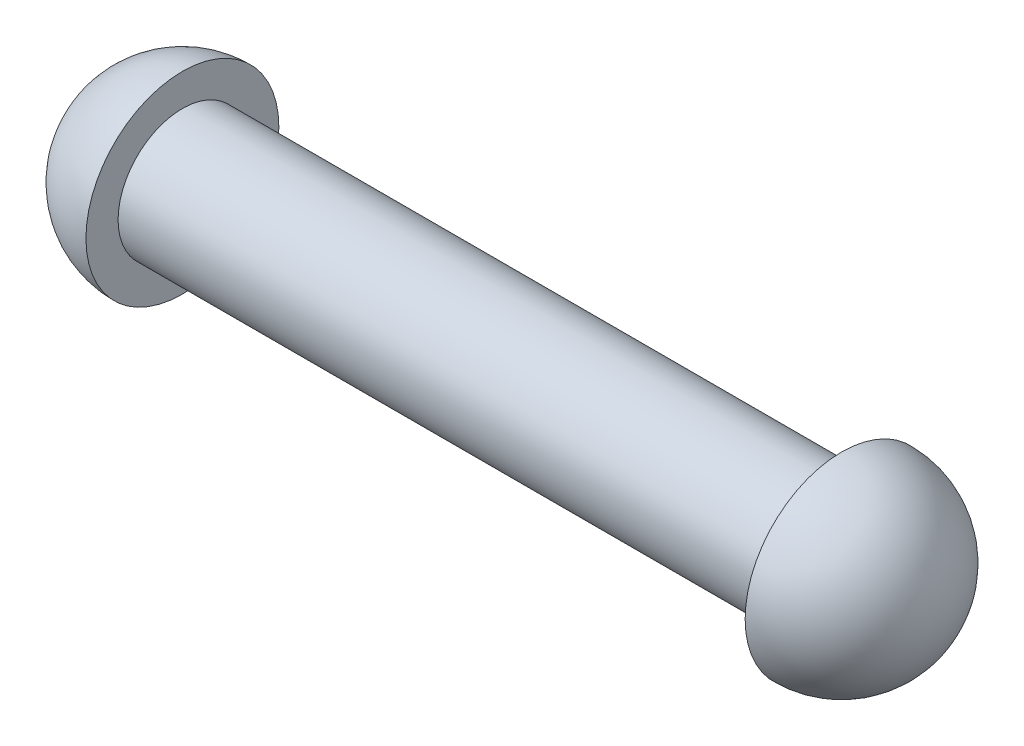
ISO-10303-21;
HEADER;
FILE_DESCRIPTION(('STEP AP214'),'2;1');
FILE_NAME('part.step','',(''),(''),'','','');
FILE_SCHEMA(('AUTOMOTIVE_DESIGN { 1 0 10303 214 1 1 1 1 }'));
ENDSEC;
DATA;
#1=APPLICATION_CONTEXT('core data for automotive mechanical design processes');
#2=APPLICATION_PROTOCOL_DEFINITION('international standard','automotive_design',2000,#1);
#3=PRODUCT_CONTEXT('',#1,'mechanical');
#4=PRODUCT('Part','Part','',(#3));
#5=PRODUCT_RELATED_PRODUCT_CATEGORY('part','',(#4));
#6=PRODUCT_DEFINITION_FORMATION('','',#4);
#7=PRODUCT_DEFINITION_CONTEXT('part definition',#1,'design');
#8=PRODUCT_DEFINITION('design','',#6,#7);
#9=PRODUCT_DEFINITION_SHAPE('','',#8);
#10=(LENGTH_UNIT() NAMED_UNIT(*) SI_UNIT(.MILLI.,.METRE.));
#11=(NAMED_UNIT(*) PLANE_ANGLE_UNIT() SI_UNIT($,.RADIAN.));
#12=(NAMED_UNIT(*) SI_UNIT($,.STERADIAN.) SOLID_ANGLE_UNIT());
#13=UNCERTAINTY_MEASURE_WITH_UNIT(LENGTH_MEASURE(1.E-05),#10,'distance_accuracy_value','');
#14=(GEOMETRIC_REPRESENTATION_CONTEXT(3) GLOBAL_UNCERTAINTY_ASSIGNED_CONTEXT((#13)) GLOBAL_UNIT_ASSIGNED_CONTEXT((#10,
#11,#12)) REPRESENTATION_CONTEXT('',''));
#15=CARTESIAN_POINT('',(0.,0.,0.));
#16=DIRECTION('',(0.,0.,1.));
#17=DIRECTION('',(1.,0.,0.));
#18=AXIS2_PLACEMENT_3D('',#15,#16,#17);
#19=CARTESIAN_POINT('',(0.,0.,0.));
#20=DIRECTION('',(-1.,0.,0.));
#21=DIRECTION('',(0.,1.,0.));
#22=AXIS2_PLACEMENT_3D('',#19,#20,#21);
#23=SPHERICAL_SURFACE('',#22,6.);
#24=CARTESIAN_POINT('',(0.,0.,0.));
#25=DIRECTION('',(-1.,0.,0.));
#26=DIRECTION('',(0.,0.,1.));
#27=AXIS2_PLACEMENT_3D('',#24,#25,#26);
#28=CIRCLE('',#27,6.);
#29=CARTESIAN_POINT('',(0.,0.,6.));
#30=VERTEX_POINT('',#29);
#31=EDGE_CURVE('E47',#30,#30,#28,.T.);
#32=ORIENTED_EDGE('',*,*,#31,.T.);
#33=EDGE_LOOP('',(#32));
#34=FACE_BOUND('',#33,.T.);
#35=ADVANCED_FACE('F33',(#34),#23,.T.);
#36=CARTESIAN_POINT('',(41.,0.,0.));
#37=DIRECTION('',(-1.,0.,0.));
#38=DIRECTION('',(0.,1.,0.));
#39=AXIS2_PLACEMENT_3D('',#36,#37,#38);
#40=SPHERICAL_SURFACE('',#39,6.);
#41=CARTESIAN_POINT('',(41.,0.,0.));
#42=DIRECTION('',(-1.,0.,0.));
#43=DIRECTION('',(0.,0.,1.));
#44=AXIS2_PLACEMENT_3D('',#41,#42,#43);
#45=CIRCLE('',#44,6.);
#46=CARTESIAN_POINT('',(41.,0.,6.));
#47=VERTEX_POINT('',#46);
#48=EDGE_CURVE('E10',#47,#47,#45,.T.);
#49=ORIENTED_EDGE('',*,*,#48,.F.);
#50=EDGE_LOOP('',(#49));
#51=FACE_BOUND('',#50,.T.);
#52=ADVANCED_FACE('F67',(#51),#40,.T.);
#53=CARTESIAN_POINT('',(41.,4.,0.));
#54=DIRECTION('',(1.,0.,0.));
#55=DIRECTION('',(0.,0.,-1.));
#56=AXIS2_PLACEMENT_3D('',#53,#54,#55);
#57=PLANE('',#56);
#58=CARTESIAN_POINT('',(41.,0.,0.));
#59=DIRECTION('',(-1.,0.,0.));
#60=DIRECTION('',(0.,0.,1.));
#61=AXIS2_PLACEMENT_3D('',#58,#59,#60);
#62=CIRCLE('',#61,4.);
#63=CARTESIAN_POINT('',(41.,0.,4.));
#64=VERTEX_POINT('',#63);
#65=EDGE_CURVE('E39',#64,#64,#62,.T.);
#66=ORIENTED_EDGE('',*,*,#65,.F.);
#67=EDGE_LOOP('',(#66));
#68=FACE_BOUND('',#67,.T.);
#69=ORIENTED_EDGE('',*,*,#48,.T.);
#70=EDGE_LOOP('',(#69));
#71=FACE_BOUND('',#70,.T.);
#72=ADVANCED_FACE('F62',(#68,#71),#57,.F.);
#73=CARTESIAN_POINT('',(-6.,0.,0.));
#74=DIRECTION('',(-1.,0.,0.));
#75=DIRECTION('',(0.,0.,1.));
#76=AXIS2_PLACEMENT_3D('',#73,#74,#75);
#77=CYLINDRICAL_SURFACE('',#76,4.);
#78=CARTESIAN_POINT('',(0.,0.,0.));
#79=DIRECTION('',(-1.,0.,0.));
#80=DIRECTION('',(0.,0.,1.));
#81=AXIS2_PLACEMENT_3D('',#78,#79,#80);
#82=CIRCLE('',#81,4.);
#83=CARTESIAN_POINT('',(0.,0.,4.));
#84=VERTEX_POINT('',#83);
#85=EDGE_CURVE('E43',#84,#84,#82,.T.);
#86=ORIENTED_EDGE('',*,*,#85,.F.);
#87=EDGE_LOOP('',(#86));
#88=FACE_BOUND('',#87,.T.);
#89=ORIENTED_EDGE('',*,*,#65,.T.);
#90=EDGE_LOOP('',(#89));
#91=FACE_BOUND('',#90,.T.);
#92=ADVANCED_FACE('F57',(#88,#91),#77,.T.);
#93=CARTESIAN_POINT('',(0.,6.,0.));
#94=DIRECTION('',(-1.,0.,0.));
#95=DIRECTION('',(0.,0.,1.));
#96=AXIS2_PLACEMENT_3D('',#93,#94,#95);
#97=PLANE('',#96);
#98=ORIENTED_EDGE('',*,*,#31,.F.);
#99=EDGE_LOOP('',(#98));
#100=FACE_BOUND('',#99,.T.);
#101=ORIENTED_EDGE('',*,*,#85,.T.);
#102=EDGE_LOOP('',(#101));
#103=FACE_BOUND('',#102,.T.);
#104=ADVANCED_FACE('F54',(#100,#103),#97,.F.);
#105=CLOSED_SHELL('',(#35,#52,#72,#92,#104));
#106=MANIFOLD_SOLID_BREP('B2',#105);
#107=ADVANCED_BREP_SHAPE_REPRESENTATION('',(#18,#106),#14);
#108=SHAPE_DEFINITION_REPRESENTATION(#9,#107);
ENDSEC;
END-ISO-10303-21;
